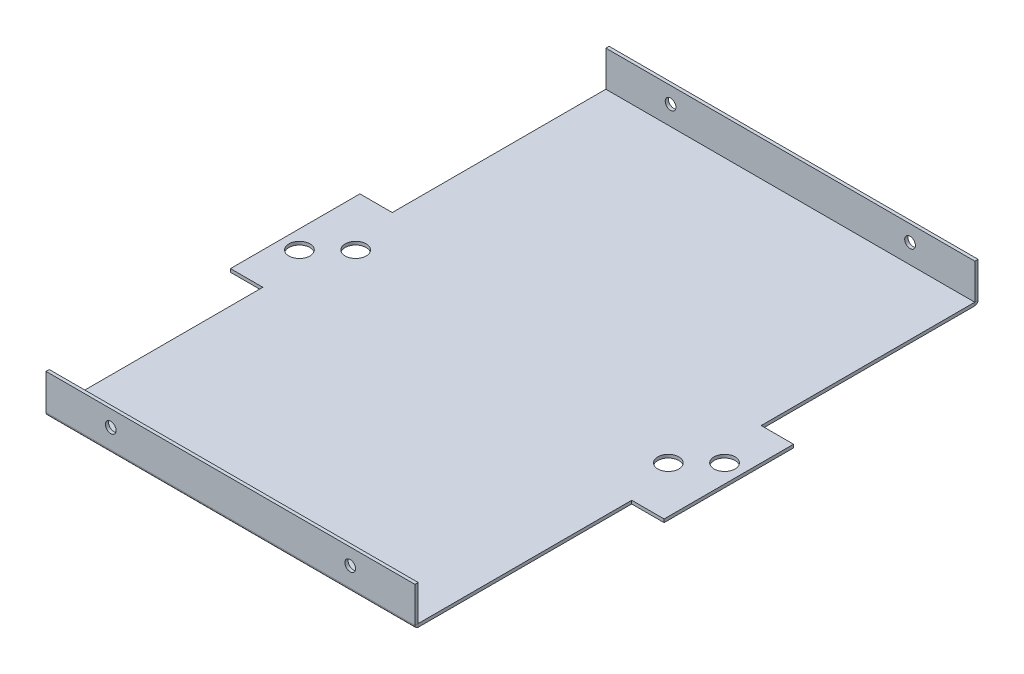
ISO-10303-21;
HEADER;
FILE_DESCRIPTION(('STEP AP214'),'2;1');
FILE_NAME('part.step','',(''),(''),'','','');
FILE_SCHEMA(('AUTOMOTIVE_DESIGN { 1 0 10303 214 1 1 1 1 }'));
ENDSEC;
DATA;
#1=APPLICATION_CONTEXT('core data for automotive mechanical design processes');
#2=APPLICATION_PROTOCOL_DEFINITION('international standard','automotive_design',2000,#1);
#3=PRODUCT_CONTEXT('',#1,'mechanical');
#4=PRODUCT('Part','Part','',(#3));
#5=PRODUCT_RELATED_PRODUCT_CATEGORY('part','',(#4));
#6=PRODUCT_DEFINITION_FORMATION('','',#4);
#7=PRODUCT_DEFINITION_CONTEXT('part definition',#1,'design');
#8=PRODUCT_DEFINITION('design','',#6,#7);
#9=PRODUCT_DEFINITION_SHAPE('','',#8);
#10=(LENGTH_UNIT() NAMED_UNIT(*) SI_UNIT(.MILLI.,.METRE.));
#11=(NAMED_UNIT(*) PLANE_ANGLE_UNIT() SI_UNIT($,.RADIAN.));
#12=(NAMED_UNIT(*) SI_UNIT($,.STERADIAN.) SOLID_ANGLE_UNIT());
#13=UNCERTAINTY_MEASURE_WITH_UNIT(LENGTH_MEASURE(1.E-05),#10,'distance_accuracy_value','');
#14=(GEOMETRIC_REPRESENTATION_CONTEXT(3) GLOBAL_UNCERTAINTY_ASSIGNED_CONTEXT((#13)) GLOBAL_UNIT_ASSIGNED_CONTEXT((#10,
#11,#12)) REPRESENTATION_CONTEXT('',''));
#15=CARTESIAN_POINT('',(0.,0.,0.));
#16=DIRECTION('',(0.,0.,1.));
#17=DIRECTION('',(1.,0.,0.));
#18=AXIS2_PLACEMENT_3D('',#15,#16,#17);
#19=CARTESIAN_POINT('',(114.,1.,0.));
#20=DIRECTION('',(-1.,0.,0.));
#21=DIRECTION('',(0.,0.,1.));
#22=AXIS2_PLACEMENT_3D('',#19,#20,#21);
#23=PLANE('',#22);
#24=DIRECTION('',(0.,0.,-1.));
#25=VECTOR('',#24,1.);
#26=CARTESIAN_POINT('',(114.,1.,0.));
#27=LINE('',#26,#25);
#28=CARTESIAN_POINT('',(114.,1.,-11.0001));
#29=VERTEX_POINT('',#28);
#30=CARTESIAN_POINT('',(114.,1.,-77.));
#31=VERTEX_POINT('',#30);
#32=EDGE_CURVE('E41',#29,#31,#27,.T.);
#33=ORIENTED_EDGE('',*,*,#32,.F.);
#34=DIRECTION('',(0.,-1.,0.));
#35=VECTOR('',#34,1.);
#36=CARTESIAN_POINT('',(114.,0.999999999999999,-11.0001));
#37=LINE('',#36,#35);
#38=CARTESIAN_POINT('',(114.,0.,-11.0001));
#39=VERTEX_POINT('',#38);
#40=EDGE_CURVE('E12',#29,#39,#37,.T.);
#41=ORIENTED_EDGE('',*,*,#40,.T.);
#42=DIRECTION('',(0.,0.,-1.));
#43=VECTOR('',#42,1.);
#44=CARTESIAN_POINT('',(114.,0.,0.));
#45=LINE('',#44,#43);
#46=CARTESIAN_POINT('',(114.,0.,-77.));
#47=VERTEX_POINT('',#46);
#48=EDGE_CURVE('E322',#39,#47,#45,.T.);
#49=ORIENTED_EDGE('',*,*,#48,.T.);
#50=DIRECTION('',(0.,-1.,0.));
#51=VECTOR('',#50,1.);
#52=CARTESIAN_POINT('',(114.,1.,-77.));
#53=LINE('',#52,#51);
#54=EDGE_CURVE('E354',#31,#47,#53,.T.);
#55=ORIENTED_EDGE('',*,*,#54,.F.);
#56=EDGE_LOOP('',(#33,#41,#49,#55));
#57=FACE_BOUND('',#56,.T.);
#58=ADVANCED_FACE('F38',(#57),#23,.F.);
#59=CARTESIAN_POINT('',(0.,1.,0.));
#60=DIRECTION('',(1.,0.,0.));
#61=DIRECTION('',(0.,0.,-1.));
#62=AXIS2_PLACEMENT_3D('',#59,#60,#61);
#63=PLANE('',#62);
#64=DIRECTION('',(0.,0.,1.));
#65=VECTOR('',#64,1.);
#66=CARTESIAN_POINT('',(0.,0.,0.));
#67=LINE('',#66,#65);
#68=CARTESIAN_POINT('',(0.,0.,-77.));
#69=VERTEX_POINT('',#68);
#70=CARTESIAN_POINT('',(0.,0.,-11.0000999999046));
#71=VERTEX_POINT('',#70);
#72=EDGE_CURVE('E301',#69,#71,#67,.T.);
#73=ORIENTED_EDGE('',*,*,#72,.T.);
#74=DIRECTION('',(0.,1.,0.));
#75=VECTOR('',#74,1.);
#76=CARTESIAN_POINT('',(0.,0.999999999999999,-11.0001));
#77=LINE('',#76,#75);
#78=CARTESIAN_POINT('',(0.,1.,-11.0001));
#79=VERTEX_POINT('',#78);
#80=EDGE_CURVE('E375',#71,#79,#77,.T.);
#81=ORIENTED_EDGE('',*,*,#80,.T.);
#82=DIRECTION('',(0.,0.,1.));
#83=VECTOR('',#82,1.);
#84=CARTESIAN_POINT('',(0.,1.,0.));
#85=LINE('',#84,#83);
#86=CARTESIAN_POINT('',(0.,1.,-77.));
#87=VERTEX_POINT('',#86);
#88=EDGE_CURVE('E333',#87,#79,#85,.T.);
#89=ORIENTED_EDGE('',*,*,#88,.F.);
#90=DIRECTION('',(0.,-1.,0.));
#91=VECTOR('',#90,1.);
#92=CARTESIAN_POINT('',(0.,1.,-77.));
#93=LINE('',#92,#91);
#94=EDGE_CURVE('E318',#87,#69,#93,.T.);
#95=ORIENTED_EDGE('',*,*,#94,.T.);
#96=EDGE_LOOP('',(#73,#81,#89,#95));
#97=FACE_BOUND('',#96,.T.);
#98=ADVANCED_FACE('F444',(#97),#63,.F.);
#99=CARTESIAN_POINT('',(0.,0.,-77.));
#100=DIRECTION('',(0.,1.,0.));
#101=DIRECTION('',(0.,0.,1.));
#102=AXIS2_PLACEMENT_3D('',#99,#100,#101);
#103=PLANE('',#102);
#104=CARTESIAN_POINT('',(-4.34314575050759,0.,-92.6568542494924));
#105=DIRECTION('',(0.,1.,0.));
#106=DIRECTION('',(0.,0.,1.));
#107=AXIS2_PLACEMENT_3D('',#104,#105,#106);
#108=CIRCLE('',#107,3.25);
#109=CARTESIAN_POINT('',(-4.34314575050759,0.,-89.4068542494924));
#110=VERTEX_POINT('',#109);
#111=EDGE_CURVE('E275',#110,#110,#108,.T.);
#112=ORIENTED_EDGE('',*,*,#111,.T.);
#113=EDGE_LOOP('',(#112));
#114=FACE_BOUND('',#113,.T.);
#115=CARTESIAN_POINT('',(109.656854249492,0.,-92.6568542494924));
#116=DIRECTION('',(0.,1.,0.));
#117=DIRECTION('',(0.,0.,1.));
#118=AXIS2_PLACEMENT_3D('',#115,#116,#117);
#119=CIRCLE('',#118,3.25000000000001);
#120=CARTESIAN_POINT('',(109.656854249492,0.,-89.4068542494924));
#121=VERTEX_POINT('',#120);
#122=EDGE_CURVE('E289',#121,#121,#119,.T.);
#123=ORIENTED_EDGE('',*,*,#122,.T.);
#124=EDGE_LOOP('',(#123));
#125=FACE_BOUND('',#124,.T.);
#126=CARTESIAN_POINT('',(118.343145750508,0.,-101.343145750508));
#127=DIRECTION('',(0.,1.,0.));
#128=DIRECTION('',(0.,0.,1.));
#129=AXIS2_PLACEMENT_3D('',#126,#127,#128);
#130=CIRCLE('',#129,3.25000000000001);
#131=CARTESIAN_POINT('',(118.343145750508,0.,-98.0931457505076));
#132=VERTEX_POINT('',#131);
#133=EDGE_CURVE('E295',#132,#132,#130,.T.);
#134=ORIENTED_EDGE('',*,*,#133,.T.);
#135=EDGE_LOOP('',(#134));
#136=FACE_BOUND('',#135,.T.);
#137=CARTESIAN_POINT('',(4.34314575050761,0.,-101.343145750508));
#138=DIRECTION('',(0.,1.,0.));
#139=DIRECTION('',(0.,0.,1.));
#140=AXIS2_PLACEMENT_3D('',#137,#138,#139);
#141=CIRCLE('',#140,3.25);
#142=CARTESIAN_POINT('',(4.34314575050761,0.,-98.0931457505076));
#143=VERTEX_POINT('',#142);
#144=EDGE_CURVE('E283',#143,#143,#141,.T.);
#145=ORIENTED_EDGE('',*,*,#144,.T.);
#146=EDGE_LOOP('',(#145));
#147=FACE_BOUND('',#146,.T.);
#148=ORIENTED_EDGE('',*,*,#48,.F.);
#149=DIRECTION('',(-1.,0.,0.));
#150=VECTOR('',#149,1.);
#151=CARTESIAN_POINT('',(0.,0.,-11.0001));
#152=LINE('',#151,#150);
#153=EDGE_CURVE('E46',#39,#71,#152,.T.);
#154=ORIENTED_EDGE('',*,*,#153,.T.);
#155=ORIENTED_EDGE('',*,*,#72,.F.);
#156=DIRECTION('',(1.,0.,0.));
#157=VECTOR('',#156,1.);
#158=CARTESIAN_POINT('',(0.,0.,-77.));
#159=LINE('',#158,#157);
#160=CARTESIAN_POINT('',(-9.99999999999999,0.,-77.));
#161=VERTEX_POINT('',#160);
#162=EDGE_CURVE('E331',#161,#69,#159,.T.);
#163=ORIENTED_EDGE('',*,*,#162,.F.);
#164=DIRECTION('',(0.,0.,1.));
#165=VECTOR('',#164,1.);
#166=CARTESIAN_POINT('',(-9.99999999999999,0.,-77.));
#167=LINE('',#166,#165);
#168=CARTESIAN_POINT('',(-10.,0.,-117.));
#169=VERTEX_POINT('',#168);
#170=EDGE_CURVE('E329',#169,#161,#167,.T.);
#171=ORIENTED_EDGE('',*,*,#170,.F.);
#172=DIRECTION('',(-1.,0.,0.));
#173=VECTOR('',#172,1.);
#174=CARTESIAN_POINT('',(-10.,0.,-117.));
#175=LINE('',#174,#173);
#176=CARTESIAN_POINT('',(0.,0.,-117.));
#177=VERTEX_POINT('',#176);
#178=EDGE_CURVE('E327',#177,#169,#175,.T.);
#179=ORIENTED_EDGE('',*,*,#178,.F.);
#180=DIRECTION('',(0.,0.,1.));
#181=VECTOR('',#180,1.);
#182=CARTESIAN_POINT('',(0.,0.,-117.));
#183=LINE('',#182,#181);
#184=CARTESIAN_POINT('',(0.,0.,-182.9999));
#185=VERTEX_POINT('',#184);
#186=EDGE_CURVE('E62',#185,#177,#183,.T.);
#187=ORIENTED_EDGE('',*,*,#186,.F.);
#188=DIRECTION('',(-1.,0.,0.));
#189=VECTOR('',#188,1.);
#190=CARTESIAN_POINT('',(0.,0.,-182.9999));
#191=LINE('',#190,#189);
#192=CARTESIAN_POINT('',(114.,0.,-182.9999));
#193=VERTEX_POINT('',#192);
#194=EDGE_CURVE('E363',#193,#185,#191,.T.);
#195=ORIENTED_EDGE('',*,*,#194,.F.);
#196=DIRECTION('',(0.,0.,-1.));
#197=VECTOR('',#196,1.);
#198=CARTESIAN_POINT('',(114.,0.,-117.));
#199=LINE('',#198,#197);
#200=CARTESIAN_POINT('',(114.,0.,-117.));
#201=VERTEX_POINT('',#200);
#202=EDGE_CURVE('E326',#201,#193,#199,.T.);
#203=ORIENTED_EDGE('',*,*,#202,.F.);
#204=DIRECTION('',(-1.,0.,0.));
#205=VECTOR('',#204,1.);
#206=CARTESIAN_POINT('',(114.,0.,-117.));
#207=LINE('',#206,#205);
#208=CARTESIAN_POINT('',(124.,0.,-117.));
#209=VERTEX_POINT('',#208);
#210=EDGE_CURVE('E324',#209,#201,#207,.T.);
#211=ORIENTED_EDGE('',*,*,#210,.F.);
#212=DIRECTION('',(0.,0.,-1.));
#213=VECTOR('',#212,1.);
#214=CARTESIAN_POINT('',(124.,0.,-117.));
#215=LINE('',#214,#213);
#216=CARTESIAN_POINT('',(124.,0.,-77.));
#217=VERTEX_POINT('',#216);
#218=EDGE_CURVE('E321',#217,#209,#215,.T.);
#219=ORIENTED_EDGE('',*,*,#218,.F.);
#220=DIRECTION('',(1.,0.,0.));
#221=VECTOR('',#220,1.);
#222=CARTESIAN_POINT('',(124.,0.,-77.));
#223=LINE('',#222,#221);
#224=EDGE_CURVE('E319',#47,#217,#223,.T.);
#225=ORIENTED_EDGE('',*,*,#224,.F.);
#226=EDGE_LOOP('',(#148,#154,#155,#163,#171,#179,#187,#195,#203,#211,#219,#225));
#227=FACE_BOUND('',#226,.T.);
#228=ADVANCED_FACE('F503',(#114,#125,#136,#147,#227),#103,.F.);
#229=CARTESIAN_POINT('',(0.,1.,-77.));
#230=DIRECTION('',(0.,1.,0.));
#231=DIRECTION('',(0.,0.,1.));
#232=AXIS2_PLACEMENT_3D('',#229,#230,#231);
#233=PLANE('',#232);
#234=DIRECTION('',(-1.,0.,0.));
#235=VECTOR('',#234,1.);
#236=CARTESIAN_POINT('',(0.,1.,-11.0001));
#237=LINE('',#236,#235);
#238=EDGE_CURVE('E369',#29,#79,#237,.T.);
#239=ORIENTED_EDGE('',*,*,#238,.F.);
#240=ORIENTED_EDGE('',*,*,#32,.T.);
#241=DIRECTION('',(1.,0.,0.));
#242=VECTOR('',#241,1.);
#243=CARTESIAN_POINT('',(124.,1.,-77.));
#244=LINE('',#243,#242);
#245=CARTESIAN_POINT('',(124.,1.,-77.));
#246=VERTEX_POINT('',#245);
#247=EDGE_CURVE('E304',#31,#246,#244,.T.);
#248=ORIENTED_EDGE('',*,*,#247,.T.);
#249=DIRECTION('',(0.,0.,-1.));
#250=VECTOR('',#249,1.);
#251=CARTESIAN_POINT('',(124.,1.,-117.));
#252=LINE('',#251,#250);
#253=CARTESIAN_POINT('',(124.,1.,-117.));
#254=VERTEX_POINT('',#253);
#255=EDGE_CURVE('E306',#246,#254,#252,.T.);
#256=ORIENTED_EDGE('',*,*,#255,.T.);
#257=DIRECTION('',(-1.,0.,0.));
#258=VECTOR('',#257,1.);
#259=CARTESIAN_POINT('',(114.,1.,-117.));
#260=LINE('',#259,#258);
#261=CARTESIAN_POINT('',(114.,1.,-117.));
#262=VERTEX_POINT('',#261);
#263=EDGE_CURVE('E308',#254,#262,#260,.T.);
#264=ORIENTED_EDGE('',*,*,#263,.T.);
#265=DIRECTION('',(0.,0.,-1.));
#266=VECTOR('',#265,1.);
#267=CARTESIAN_POINT('',(114.,1.,-117.));
#268=LINE('',#267,#266);
#269=CARTESIAN_POINT('',(114.,1.,-182.9999));
#270=VERTEX_POINT('',#269);
#271=EDGE_CURVE('E310',#262,#270,#268,.T.);
#272=ORIENTED_EDGE('',*,*,#271,.T.);
#273=DIRECTION('',(-1.,0.,0.));
#274=VECTOR('',#273,1.);
#275=CARTESIAN_POINT('',(0.,1.,-182.9999));
#276=LINE('',#275,#274);
#277=CARTESIAN_POINT('',(0.,0.999999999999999,-182.9999));
#278=VERTEX_POINT('',#277);
#279=EDGE_CURVE('E357',#270,#278,#276,.T.);
#280=ORIENTED_EDGE('',*,*,#279,.T.);
#281=DIRECTION('',(0.,0.,1.));
#282=VECTOR('',#281,1.);
#283=CARTESIAN_POINT('',(0.,1.,-117.));
#284=LINE('',#283,#282);
#285=CARTESIAN_POINT('',(0.,1.,-117.));
#286=VERTEX_POINT('',#285);
#287=EDGE_CURVE('E314',#278,#286,#284,.T.);
#288=ORIENTED_EDGE('',*,*,#287,.T.);
#289=DIRECTION('',(-1.,0.,0.));
#290=VECTOR('',#289,1.);
#291=CARTESIAN_POINT('',(-10.,1.,-117.));
#292=LINE('',#291,#290);
#293=CARTESIAN_POINT('',(-10.,1.,-117.));
#294=VERTEX_POINT('',#293);
#295=EDGE_CURVE('E311',#286,#294,#292,.T.);
#296=ORIENTED_EDGE('',*,*,#295,.T.);
#297=DIRECTION('',(0.,0.,1.));
#298=VECTOR('',#297,1.);
#299=CARTESIAN_POINT('',(-9.99999999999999,1.,-77.));
#300=LINE('',#299,#298);
#301=CARTESIAN_POINT('',(-9.99999999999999,1.,-77.));
#302=VERTEX_POINT('',#301);
#303=EDGE_CURVE('E313',#294,#302,#300,.T.);
#304=ORIENTED_EDGE('',*,*,#303,.T.);
#305=DIRECTION('',(1.,0.,0.));
#306=VECTOR('',#305,1.);
#307=CARTESIAN_POINT('',(0.,1.,-77.));
#308=LINE('',#307,#306);
#309=EDGE_CURVE('E316',#302,#87,#308,.T.);
#310=ORIENTED_EDGE('',*,*,#309,.T.);
#311=ORIENTED_EDGE('',*,*,#88,.T.);
#312=EDGE_LOOP('',(#239,#240,#248,#256,#264,#272,#280,#288,#296,#304,#310,#311));
#313=FACE_BOUND('',#312,.T.);
#314=CARTESIAN_POINT('',(-4.34314575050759,1.,-92.6568542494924));
#315=DIRECTION('',(0.,1.,0.));
#316=DIRECTION('',(0.,0.,1.));
#317=AXIS2_PLACEMENT_3D('',#314,#315,#316);
#318=CIRCLE('',#317,3.25);
#319=CARTESIAN_POINT('',(-4.34314575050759,1.,-89.4068542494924));
#320=VERTEX_POINT('',#319);
#321=EDGE_CURVE('E280',#320,#320,#318,.T.);
#322=ORIENTED_EDGE('',*,*,#321,.F.);
#323=EDGE_LOOP('',(#322));
#324=FACE_BOUND('',#323,.T.);
#325=CARTESIAN_POINT('',(109.656854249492,1.,-92.6568542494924));
#326=DIRECTION('',(0.,1.,0.));
#327=DIRECTION('',(0.,0.,1.));
#328=AXIS2_PLACEMENT_3D('',#325,#326,#327);
#329=CIRCLE('',#328,3.25000000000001);
#330=CARTESIAN_POINT('',(109.656854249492,1.,-89.4068542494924));
#331=VERTEX_POINT('',#330);
#332=EDGE_CURVE('E292',#331,#331,#329,.T.);
#333=ORIENTED_EDGE('',*,*,#332,.F.);
#334=EDGE_LOOP('',(#333));
#335=FACE_BOUND('',#334,.T.);
#336=CARTESIAN_POINT('',(118.343145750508,1.,-101.343145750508));
#337=DIRECTION('',(0.,1.,0.));
#338=DIRECTION('',(0.,0.,1.));
#339=AXIS2_PLACEMENT_3D('',#336,#337,#338);
#340=CIRCLE('',#339,3.25000000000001);
#341=CARTESIAN_POINT('',(118.343145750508,1.,-98.0931457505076));
#342=VERTEX_POINT('',#341);
#343=EDGE_CURVE('E298',#342,#342,#340,.T.);
#344=ORIENTED_EDGE('',*,*,#343,.F.);
#345=EDGE_LOOP('',(#344));
#346=FACE_BOUND('',#345,.T.);
#347=CARTESIAN_POINT('',(4.34314575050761,1.,-101.343145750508));
#348=DIRECTION('',(0.,1.,0.));
#349=DIRECTION('',(0.,0.,1.));
#350=AXIS2_PLACEMENT_3D('',#347,#348,#349);
#351=CIRCLE('',#350,3.25);
#352=CARTESIAN_POINT('',(4.34314575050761,1.,-98.0931457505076));
#353=VERTEX_POINT('',#352);
#354=EDGE_CURVE('E286',#353,#353,#351,.T.);
#355=ORIENTED_EDGE('',*,*,#354,.F.);
#356=EDGE_LOOP('',(#355));
#357=FACE_BOUND('',#356,.T.);
#358=ADVANCED_FACE('F388',(#313,#324,#335,#346,#357),#233,.T.);
#359=CARTESIAN_POINT('',(124.,1.,-77.));
#360=DIRECTION('',(0.,0.,-1.));
#361=DIRECTION('',(-1.,0.,0.));
#362=AXIS2_PLACEMENT_3D('',#359,#360,#361);
#363=PLANE('',#362);
#364=ORIENTED_EDGE('',*,*,#224,.T.);
#365=DIRECTION('',(0.,-1.,0.));
#366=VECTOR('',#365,1.);
#367=CARTESIAN_POINT('',(124.,1.,-77.));
#368=LINE('',#367,#366);
#369=EDGE_CURVE('E351',#246,#217,#368,.T.);
#370=ORIENTED_EDGE('',*,*,#369,.F.);
#371=ORIENTED_EDGE('',*,*,#247,.F.);
#372=ORIENTED_EDGE('',*,*,#54,.T.);
#373=EDGE_LOOP('',(#364,#370,#371,#372));
#374=FACE_BOUND('',#373,.T.);
#375=ADVANCED_FACE('F396',(#374),#363,.F.);
#376=CARTESIAN_POINT('',(124.,1.,-117.));
#377=DIRECTION('',(-1.,0.,0.));
#378=DIRECTION('',(0.,0.,1.));
#379=AXIS2_PLACEMENT_3D('',#376,#377,#378);
#380=PLANE('',#379);
#381=ORIENTED_EDGE('',*,*,#218,.T.);
#382=DIRECTION('',(0.,-1.,0.));
#383=VECTOR('',#382,1.);
#384=CARTESIAN_POINT('',(124.,1.,-117.));
#385=LINE('',#384,#383);
#386=EDGE_CURVE('E348',#254,#209,#385,.T.);
#387=ORIENTED_EDGE('',*,*,#386,.F.);
#388=ORIENTED_EDGE('',*,*,#255,.F.);
#389=ORIENTED_EDGE('',*,*,#369,.T.);
#390=EDGE_LOOP('',(#381,#387,#388,#389));
#391=FACE_BOUND('',#390,.T.);
#392=ADVANCED_FACE('F401',(#391),#380,.F.);
#393=CARTESIAN_POINT('',(114.,1.,-117.));
#394=DIRECTION('',(0.,0.,1.));
#395=DIRECTION('',(1.,0.,0.));
#396=AXIS2_PLACEMENT_3D('',#393,#394,#395);
#397=PLANE('',#396);
#398=ORIENTED_EDGE('',*,*,#210,.T.);
#399=DIRECTION('',(0.,-1.,0.));
#400=VECTOR('',#399,1.);
#401=CARTESIAN_POINT('',(114.,1.,-117.));
#402=LINE('',#401,#400);
#403=EDGE_CURVE('E345',#262,#201,#402,.T.);
#404=ORIENTED_EDGE('',*,*,#403,.F.);
#405=ORIENTED_EDGE('',*,*,#263,.F.);
#406=ORIENTED_EDGE('',*,*,#386,.T.);
#407=EDGE_LOOP('',(#398,#404,#405,#406));
#408=FACE_BOUND('',#407,.T.);
#409=ADVANCED_FACE('F407',(#408),#397,.F.);
#410=CARTESIAN_POINT('',(114.,1.,-117.));
#411=DIRECTION('',(-1.,0.,0.));
#412=DIRECTION('',(0.,0.,1.));
#413=AXIS2_PLACEMENT_3D('',#410,#411,#412);
#414=PLANE('',#413);
#415=DIRECTION('',(0.,-1.,0.));
#416=VECTOR('',#415,1.);
#417=CARTESIAN_POINT('',(114.,0.999999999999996,-182.9999));
#418=LINE('',#417,#416);
#419=EDGE_CURVE('E360',#270,#193,#418,.T.);
#420=ORIENTED_EDGE('',*,*,#419,.F.);
#421=ORIENTED_EDGE('',*,*,#271,.F.);
#422=ORIENTED_EDGE('',*,*,#403,.T.);
#423=ORIENTED_EDGE('',*,*,#202,.T.);
#424=EDGE_LOOP('',(#420,#421,#422,#423));
#425=FACE_BOUND('',#424,.T.);
#426=ADVANCED_FACE('F411',(#425),#414,.F.);
#427=CARTESIAN_POINT('',(0.,1.,-117.));
#428=DIRECTION('',(1.,0.,0.));
#429=DIRECTION('',(0.,0.,-1.));
#430=AXIS2_PLACEMENT_3D('',#427,#428,#429);
#431=PLANE('',#430);
#432=DIRECTION('',(0.,1.,0.));
#433=VECTOR('',#432,1.);
#434=CARTESIAN_POINT('',(0.,0.999999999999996,-182.9999));
#435=LINE('',#434,#433);
#436=EDGE_CURVE('E366',#185,#278,#435,.T.);
#437=ORIENTED_EDGE('',*,*,#436,.F.);
#438=ORIENTED_EDGE('',*,*,#186,.T.);
#439=DIRECTION('',(0.,-1.,0.));
#440=VECTOR('',#439,1.);
#441=CARTESIAN_POINT('',(0.,1.,-117.));
#442=LINE('',#441,#440);
#443=EDGE_CURVE('E342',#286,#177,#442,.T.);
#444=ORIENTED_EDGE('',*,*,#443,.F.);
#445=ORIENTED_EDGE('',*,*,#287,.F.);
#446=EDGE_LOOP('',(#437,#438,#444,#445));
#447=FACE_BOUND('',#446,.T.);
#448=ADVANCED_FACE('F427',(#447),#431,.F.);
#449=CARTESIAN_POINT('',(-10.,1.,-117.));
#450=DIRECTION('',(0.,0.,1.));
#451=DIRECTION('',(1.,0.,0.));
#452=AXIS2_PLACEMENT_3D('',#449,#450,#451);
#453=PLANE('',#452);
#454=ORIENTED_EDGE('',*,*,#178,.T.);
#455=DIRECTION('',(0.,-1.,0.));
#456=VECTOR('',#455,1.);
#457=CARTESIAN_POINT('',(-10.,1.,-117.));
#458=LINE('',#457,#456);
#459=EDGE_CURVE('E339',#294,#169,#458,.T.);
#460=ORIENTED_EDGE('',*,*,#459,.F.);
#461=ORIENTED_EDGE('',*,*,#295,.F.);
#462=ORIENTED_EDGE('',*,*,#443,.T.);
#463=EDGE_LOOP('',(#454,#460,#461,#462));
#464=FACE_BOUND('',#463,.T.);
#465=ADVANCED_FACE('F431',(#464),#453,.F.);
#466=CARTESIAN_POINT('',(-9.99999999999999,1.,-77.));
#467=DIRECTION('',(1.,0.,0.));
#468=DIRECTION('',(0.,0.,-1.));
#469=AXIS2_PLACEMENT_3D('',#466,#467,#468);
#470=PLANE('',#469);
#471=ORIENTED_EDGE('',*,*,#170,.T.);
#472=DIRECTION('',(0.,-1.,0.));
#473=VECTOR('',#472,1.);
#474=CARTESIAN_POINT('',(-9.99999999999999,1.,-77.));
#475=LINE('',#474,#473);
#476=EDGE_CURVE('E336',#302,#161,#475,.T.);
#477=ORIENTED_EDGE('',*,*,#476,.F.);
#478=ORIENTED_EDGE('',*,*,#303,.F.);
#479=ORIENTED_EDGE('',*,*,#459,.T.);
#480=EDGE_LOOP('',(#471,#477,#478,#479));
#481=FACE_BOUND('',#480,.T.);
#482=ADVANCED_FACE('F437',(#481),#470,.F.);
#483=CARTESIAN_POINT('',(0.,1.,-77.));
#484=DIRECTION('',(0.,0.,-1.));
#485=DIRECTION('',(-1.,0.,0.));
#486=AXIS2_PLACEMENT_3D('',#483,#484,#485);
#487=PLANE('',#486);
#488=ORIENTED_EDGE('',*,*,#162,.T.);
#489=ORIENTED_EDGE('',*,*,#94,.F.);
#490=ORIENTED_EDGE('',*,*,#309,.F.);
#491=ORIENTED_EDGE('',*,*,#476,.T.);
#492=EDGE_LOOP('',(#488,#489,#490,#491));
#493=FACE_BOUND('',#492,.T.);
#494=ADVANCED_FACE('F441',(#493),#487,.F.);
#495=CARTESIAN_POINT('',(118.343145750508,1.,-101.343145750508));
#496=DIRECTION('',(0.,-1.,0.));
#497=DIRECTION('',(0.,0.,-1.));
#498=AXIS2_PLACEMENT_3D('',#495,#496,#497);
#499=CYLINDRICAL_SURFACE('',#498,3.25000000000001);
#500=ORIENTED_EDGE('',*,*,#343,.T.);
#501=EDGE_LOOP('',(#500));
#502=FACE_BOUND('',#501,.T.);
#503=ORIENTED_EDGE('',*,*,#133,.F.);
#504=EDGE_LOOP('',(#503));
#505=FACE_BOUND('',#504,.T.);
#506=ADVANCED_FACE('F528',(#502,#505),#499,.F.);
#507=CARTESIAN_POINT('',(109.656854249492,1.,-92.6568542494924));
#508=DIRECTION('',(0.,-1.,0.));
#509=DIRECTION('',(0.,0.,-1.));
#510=AXIS2_PLACEMENT_3D('',#507,#508,#509);
#511=CYLINDRICAL_SURFACE('',#510,3.25000000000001);
#512=ORIENTED_EDGE('',*,*,#332,.T.);
#513=EDGE_LOOP('',(#512));
#514=FACE_BOUND('',#513,.T.);
#515=ORIENTED_EDGE('',*,*,#122,.F.);
#516=EDGE_LOOP('',(#515));
#517=FACE_BOUND('',#516,.T.);
#518=ADVANCED_FACE('F531',(#514,#517),#511,.F.);
#519=CARTESIAN_POINT('',(4.34314575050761,1.,-101.343145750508));
#520=DIRECTION('',(0.,-1.,0.));
#521=DIRECTION('',(0.,0.,-1.));
#522=AXIS2_PLACEMENT_3D('',#519,#520,#521);
#523=CYLINDRICAL_SURFACE('',#522,3.25);
#524=ORIENTED_EDGE('',*,*,#354,.T.);
#525=EDGE_LOOP('',(#524));
#526=FACE_BOUND('',#525,.T.);
#527=ORIENTED_EDGE('',*,*,#144,.F.);
#528=EDGE_LOOP('',(#527));
#529=FACE_BOUND('',#528,.T.);
#530=ADVANCED_FACE('F535',(#526,#529),#523,.F.);
#531=CARTESIAN_POINT('',(-4.34314575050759,1.,-92.6568542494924));
#532=DIRECTION('',(0.,-1.,0.));
#533=DIRECTION('',(0.,0.,-1.));
#534=AXIS2_PLACEMENT_3D('',#531,#532,#533);
#535=CYLINDRICAL_SURFACE('',#534,3.25);
#536=ORIENTED_EDGE('',*,*,#321,.T.);
#537=EDGE_LOOP('',(#536));
#538=FACE_BOUND('',#537,.T.);
#539=ORIENTED_EDGE('',*,*,#111,.F.);
#540=EDGE_LOOP('',(#539));
#541=FACE_BOUND('',#540,.T.);
#542=ADVANCED_FACE('F539',(#538,#541),#535,.F.);
#543=CARTESIAN_POINT('',(114.,1.0001,-182.9999));
#544=DIRECTION('',(-1.,0.,0.));
#545=DIRECTION('',(0.,0.,1.));
#546=AXIS2_PLACEMENT_3D('',#543,#544,#545);
#547=PLANE('',#546);
#548=ORIENTED_EDGE('',*,*,#419,.T.);
#549=CARTESIAN_POINT('',(114.,1.0001,-182.9999));
#550=DIRECTION('',(-1.,0.,0.));
#551=DIRECTION('',(0.,0.,1.));
#552=AXIS2_PLACEMENT_3D('',#549,#550,#551);
#553=CIRCLE('',#552,1.0001);
#554=CARTESIAN_POINT('',(114.,1.0001,-184.));
#555=VERTEX_POINT('',#554);
#556=EDGE_CURVE('E229',#193,#555,#553,.F.);
#557=ORIENTED_EDGE('',*,*,#556,.T.);
#558=DIRECTION('',(0.,0.,-1.));
#559=VECTOR('',#558,1.);
#560=CARTESIAN_POINT('',(114.,1.00010000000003,-183.));
#561=LINE('',#560,#559);
#562=CARTESIAN_POINT('',(114.,1.0001,-183.));
#563=VERTEX_POINT('',#562);
#564=EDGE_CURVE('E245',#563,#555,#561,.T.);
#565=ORIENTED_EDGE('',*,*,#564,.F.);
#566=CARTESIAN_POINT('',(114.,1.0001,-182.9999));
#567=DIRECTION('',(1.,0.,0.));
#568=DIRECTION('',(0.,0.,-1.));
#569=AXIS2_PLACEMENT_3D('',#566,#567,#568);
#570=CIRCLE('',#569,0.000100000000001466);
#571=EDGE_CURVE('E268',#270,#563,#570,.T.);
#572=ORIENTED_EDGE('',*,*,#571,.F.);
#573=EDGE_LOOP('',(#548,#557,#565,#572));
#574=FACE_BOUND('',#573,.T.);
#575=ADVANCED_FACE('F417',(#574),#547,.F.);
#576=CARTESIAN_POINT('',(0.,1.0001,-182.9999));
#577=DIRECTION('',(1.,0.,0.));
#578=DIRECTION('',(0.,0.,-1.));
#579=AXIS2_PLACEMENT_3D('',#576,#577,#578);
#580=PLANE('',#579);
#581=DIRECTION('',(0.,0.,1.));
#582=VECTOR('',#581,1.);
#583=CARTESIAN_POINT('',(0.,1.00010000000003,-183.));
#584=LINE('',#583,#582);
#585=CARTESIAN_POINT('',(0.,1.0001,-184.));
#586=VERTEX_POINT('',#585);
#587=CARTESIAN_POINT('',(0.,1.00010000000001,-183.));
#588=VERTEX_POINT('',#587);
#589=EDGE_CURVE('E230',#586,#588,#584,.T.);
#590=ORIENTED_EDGE('',*,*,#589,.F.);
#591=CARTESIAN_POINT('',(0.,1.0001,-182.9999));
#592=DIRECTION('',(-1.,0.,0.));
#593=DIRECTION('',(0.,0.,1.));
#594=AXIS2_PLACEMENT_3D('',#591,#592,#593);
#595=CIRCLE('',#594,1.0001);
#596=EDGE_CURVE('E272',#586,#185,#595,.T.);
#597=ORIENTED_EDGE('',*,*,#596,.T.);
#598=ORIENTED_EDGE('',*,*,#436,.T.);
#599=CARTESIAN_POINT('',(0.,1.0001,-182.9999));
#600=DIRECTION('',(-1.,0.,0.));
#601=DIRECTION('',(0.,0.,1.));
#602=AXIS2_PLACEMENT_3D('',#599,#600,#601);
#603=CIRCLE('',#602,0.000100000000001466);
#604=EDGE_CURVE('E271',#588,#278,#603,.T.);
#605=ORIENTED_EDGE('',*,*,#604,.F.);
#606=EDGE_LOOP('',(#590,#597,#598,#605));
#607=FACE_BOUND('',#606,.T.);
#608=ADVANCED_FACE('F424',(#607),#580,.F.);
#609=CARTESIAN_POINT('',(171.004385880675,1.0001,-182.9999));
#610=DIRECTION('',(-1.,0.,0.));
#611=DIRECTION('',(0.,0.,1.));
#612=AXIS2_PLACEMENT_3D('',#609,#610,#611);
#613=CYLINDRICAL_SURFACE('',#612,0.0001);
#614=ORIENTED_EDGE('',*,*,#604,.T.);
#615=ORIENTED_EDGE('',*,*,#279,.F.);
#616=ORIENTED_EDGE('',*,*,#571,.T.);
#617=DIRECTION('',(-1.,0.,0.));
#618=VECTOR('',#617,1.);
#619=CARTESIAN_POINT('',(0.,1.00010000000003,-183.));
#620=LINE('',#619,#618);
#621=EDGE_CURVE('E222',#563,#588,#620,.T.);
#622=ORIENTED_EDGE('',*,*,#621,.T.);
#623=EDGE_LOOP('',(#614,#615,#616,#622));
#624=FACE_BOUND('',#623,.T.);
#625=ADVANCED_FACE('F419',(#624),#613,.F.);
#626=CARTESIAN_POINT('',(171.004385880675,1.0001,-182.9999));
#627=DIRECTION('',(-1.,0.,0.));
#628=DIRECTION('',(0.,0.,1.));
#629=AXIS2_PLACEMENT_3D('',#626,#627,#628);
#630=CYLINDRICAL_SURFACE('',#629,1.0001);
#631=ORIENTED_EDGE('',*,*,#596,.F.);
#632=DIRECTION('',(-1.,0.,0.));
#633=VECTOR('',#632,1.);
#634=CARTESIAN_POINT('',(0.,1.00010000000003,-184.));
#635=LINE('',#634,#633);
#636=EDGE_CURVE('E234',#555,#586,#635,.T.);
#637=ORIENTED_EDGE('',*,*,#636,.F.);
#638=ORIENTED_EDGE('',*,*,#556,.F.);
#639=ORIENTED_EDGE('',*,*,#194,.T.);
#640=EDGE_LOOP('',(#631,#637,#638,#639));
#641=FACE_BOUND('',#640,.T.);
#642=ADVANCED_FACE('F548',(#641),#630,.T.);
#643=CARTESIAN_POINT('',(20.,7.00002721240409,-183.));
#644=DIRECTION('',(0.,0.,-1.));
#645=DIRECTION('',(0.,1.,0.));
#646=AXIS2_PLACEMENT_3D('',#643,#644,#645);
#647=CYLINDRICAL_SURFACE('',#646,1.65000000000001);
#648=CARTESIAN_POINT('',(20.,7.00002721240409,-183.));
#649=DIRECTION('',(0.,0.,1.));
#650=DIRECTION('',(0.,-1.,0.));
#651=AXIS2_PLACEMENT_3D('',#648,#649,#650);
#652=CIRCLE('',#651,1.65000000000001);
#653=CARTESIAN_POINT('',(20.,5.35002721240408,-183.));
#654=VERTEX_POINT('',#653);
#655=EDGE_CURVE('E263',#654,#654,#652,.T.);
#656=ORIENTED_EDGE('',*,*,#655,.T.);
#657=EDGE_LOOP('',(#656));
#658=FACE_BOUND('',#657,.T.);
#659=CARTESIAN_POINT('',(20.,7.00002721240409,-184.));
#660=DIRECTION('',(0.,0.,1.));
#661=DIRECTION('',(0.,-1.,0.));
#662=AXIS2_PLACEMENT_3D('',#659,#660,#661);
#663=CIRCLE('',#662,1.65000000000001);
#664=CARTESIAN_POINT('',(20.,5.35002721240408,-184.));
#665=VERTEX_POINT('',#664);
#666=EDGE_CURVE('E237',#665,#665,#663,.T.);
#667=ORIENTED_EDGE('',*,*,#666,.F.);
#668=EDGE_LOOP('',(#667));
#669=FACE_BOUND('',#668,.T.);
#670=ADVANCED_FACE('F551',(#658,#669),#647,.F.);
#671=CARTESIAN_POINT('',(94.,7.00002721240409,-183.));
#672=DIRECTION('',(0.,0.,-1.));
#673=DIRECTION('',(0.,1.,0.));
#674=AXIS2_PLACEMENT_3D('',#671,#672,#673);
#675=CYLINDRICAL_SURFACE('',#674,1.65000000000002);
#676=CARTESIAN_POINT('',(94.,7.00002721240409,-183.));
#677=DIRECTION('',(0.,0.,1.));
#678=DIRECTION('',(0.,-1.,0.));
#679=AXIS2_PLACEMENT_3D('',#676,#677,#678);
#680=CIRCLE('',#679,1.65000000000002);
#681=CARTESIAN_POINT('',(94.,5.35002721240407,-183.));
#682=VERTEX_POINT('',#681);
#683=EDGE_CURVE('E260',#682,#682,#680,.T.);
#684=ORIENTED_EDGE('',*,*,#683,.T.);
#685=EDGE_LOOP('',(#684));
#686=FACE_BOUND('',#685,.T.);
#687=CARTESIAN_POINT('',(94.,7.00002721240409,-184.));
#688=DIRECTION('',(0.,0.,1.));
#689=DIRECTION('',(0.,-1.,0.));
#690=AXIS2_PLACEMENT_3D('',#687,#688,#689);
#691=CIRCLE('',#690,1.65000000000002);
#692=CARTESIAN_POINT('',(94.,5.35002721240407,-184.));
#693=VERTEX_POINT('',#692);
#694=EDGE_CURVE('E240',#693,#693,#691,.T.);
#695=ORIENTED_EDGE('',*,*,#694,.F.);
#696=EDGE_LOOP('',(#695));
#697=FACE_BOUND('',#696,.T.);
#698=ADVANCED_FACE('F574',(#686,#697),#675,.F.);
#699=CARTESIAN_POINT('',(0.,12.0000272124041,-183.));
#700=DIRECTION('',(0.,-1.,0.));
#701=DIRECTION('',(1.,0.,0.));
#702=AXIS2_PLACEMENT_3D('',#699,#700,#701);
#703=PLANE('',#702);
#704=DIRECTION('',(-1.,0.,0.));
#705=VECTOR('',#704,1.);
#706=CARTESIAN_POINT('',(0.,12.0000272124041,-184.));
#707=LINE('',#706,#705);
#708=CARTESIAN_POINT('',(114.,12.0000272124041,-184.));
#709=VERTEX_POINT('',#708);
#710=CARTESIAN_POINT('',(0.,12.0000272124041,-184.));
#711=VERTEX_POINT('',#710);
#712=EDGE_CURVE('E258',#709,#711,#707,.T.);
#713=ORIENTED_EDGE('',*,*,#712,.T.);
#714=DIRECTION('',(0.,0.,-1.));
#715=VECTOR('',#714,1.);
#716=CARTESIAN_POINT('',(0.,12.0000272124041,-183.));
#717=LINE('',#716,#715);
#718=CARTESIAN_POINT('',(0.,12.0000272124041,-183.));
#719=VERTEX_POINT('',#718);
#720=EDGE_CURVE('E226',#719,#711,#717,.T.);
#721=ORIENTED_EDGE('',*,*,#720,.F.);
#722=DIRECTION('',(-1.,0.,0.));
#723=VECTOR('',#722,1.);
#724=CARTESIAN_POINT('',(0.,12.0000272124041,-183.));
#725=LINE('',#724,#723);
#726=CARTESIAN_POINT('',(114.,12.0000272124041,-183.));
#727=VERTEX_POINT('',#726);
#728=EDGE_CURVE('E251',#727,#719,#725,.T.);
#729=ORIENTED_EDGE('',*,*,#728,.F.);
#730=DIRECTION('',(0.,0.,-1.));
#731=VECTOR('',#730,1.);
#732=CARTESIAN_POINT('',(114.,12.0000272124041,-183.));
#733=LINE('',#732,#731);
#734=EDGE_CURVE('E255',#727,#709,#733,.T.);
#735=ORIENTED_EDGE('',*,*,#734,.T.);
#736=EDGE_LOOP('',(#713,#721,#729,#735));
#737=FACE_BOUND('',#736,.T.);
#738=ADVANCED_FACE('F570',(#737),#703,.F.);
#739=CARTESIAN_POINT('',(0.,-104.999972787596,-183.));
#740=DIRECTION('',(0.,0.,1.));
#741=DIRECTION('',(0.,-1.,0.));
#742=AXIS2_PLACEMENT_3D('',#739,#740,#741);
#743=PLANE('',#742);
#744=ORIENTED_EDGE('',*,*,#621,.F.);
#745=DIRECTION('',(0.,1.,0.));
#746=VECTOR('',#745,1.);
#747=CARTESIAN_POINT('',(114.,-64.9999727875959,-183.));
#748=LINE('',#747,#746);
#749=EDGE_CURVE('E253',#563,#727,#748,.T.);
#750=ORIENTED_EDGE('',*,*,#749,.T.);
#751=ORIENTED_EDGE('',*,*,#728,.T.);
#752=DIRECTION('',(0.,-1.,0.));
#753=VECTOR('',#752,1.);
#754=CARTESIAN_POINT('',(0.,-64.9999727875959,-183.));
#755=LINE('',#754,#753);
#756=EDGE_CURVE('E248',#719,#588,#755,.T.);
#757=ORIENTED_EDGE('',*,*,#756,.T.);
#758=EDGE_LOOP('',(#744,#750,#751,#757));
#759=FACE_BOUND('',#758,.T.);
#760=ORIENTED_EDGE('',*,*,#683,.F.);
#761=EDGE_LOOP('',(#760));
#762=FACE_BOUND('',#761,.T.);
#763=ORIENTED_EDGE('',*,*,#655,.F.);
#764=EDGE_LOOP('',(#763));
#765=FACE_BOUND('',#764,.T.);
#766=ADVANCED_FACE('F566',(#759,#762,#765),#743,.T.);
#767=CARTESIAN_POINT('',(114.,-64.9999727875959,-183.));
#768=DIRECTION('',(-1.,0.,0.));
#769=DIRECTION('',(0.,-1.,0.));
#770=AXIS2_PLACEMENT_3D('',#767,#768,#769);
#771=PLANE('',#770);
#772=ORIENTED_EDGE('',*,*,#749,.F.);
#773=ORIENTED_EDGE('',*,*,#564,.T.);
#774=DIRECTION('',(0.,1.,0.));
#775=VECTOR('',#774,1.);
#776=CARTESIAN_POINT('',(114.,-64.9999727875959,-184.));
#777=LINE('',#776,#775);
#778=EDGE_CURVE('E243',#555,#709,#777,.T.);
#779=ORIENTED_EDGE('',*,*,#778,.T.);
#780=ORIENTED_EDGE('',*,*,#734,.F.);
#781=EDGE_LOOP('',(#772,#773,#779,#780));
#782=FACE_BOUND('',#781,.T.);
#783=ADVANCED_FACE('F562',(#782),#771,.F.);
#784=CARTESIAN_POINT('',(0.,-104.999972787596,-184.));
#785=DIRECTION('',(0.,0.,1.));
#786=DIRECTION('',(0.,-1.,0.));
#787=AXIS2_PLACEMENT_3D('',#784,#785,#786);
#788=PLANE('',#787);
#789=ORIENTED_EDGE('',*,*,#694,.T.);
#790=EDGE_LOOP('',(#789));
#791=FACE_BOUND('',#790,.T.);
#792=ORIENTED_EDGE('',*,*,#666,.T.);
#793=EDGE_LOOP('',(#792));
#794=FACE_BOUND('',#793,.T.);
#795=ORIENTED_EDGE('',*,*,#778,.F.);
#796=ORIENTED_EDGE('',*,*,#636,.T.);
#797=DIRECTION('',(0.,-1.,0.));
#798=VECTOR('',#797,1.);
#799=CARTESIAN_POINT('',(0.,-64.9999727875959,-184.));
#800=LINE('',#799,#798);
#801=EDGE_CURVE('E232',#711,#586,#800,.T.);
#802=ORIENTED_EDGE('',*,*,#801,.F.);
#803=ORIENTED_EDGE('',*,*,#712,.F.);
#804=EDGE_LOOP('',(#795,#796,#802,#803));
#805=FACE_BOUND('',#804,.T.);
#806=ADVANCED_FACE('F558',(#791,#794,#805),#788,.F.);
#807=CARTESIAN_POINT('',(0.,-64.9999727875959,-183.));
#808=DIRECTION('',(1.,0.,0.));
#809=DIRECTION('',(0.,1.,0.));
#810=AXIS2_PLACEMENT_3D('',#807,#808,#809);
#811=PLANE('',#810);
#812=ORIENTED_EDGE('',*,*,#801,.T.);
#813=ORIENTED_EDGE('',*,*,#589,.T.);
#814=ORIENTED_EDGE('',*,*,#756,.F.);
#815=ORIENTED_EDGE('',*,*,#720,.T.);
#816=EDGE_LOOP('',(#812,#813,#814,#815));
#817=FACE_BOUND('',#816,.T.);
#818=ADVANCED_FACE('F555',(#817),#811,.F.);
#819=CARTESIAN_POINT('',(114.,1.0001,-11.0001));
#820=DIRECTION('',(-1.,0.,0.));
#821=DIRECTION('',(0.,0.,1.));
#822=AXIS2_PLACEMENT_3D('',#819,#820,#821);
#823=PLANE('',#822);
#824=DIRECTION('',(0.,0.,1.));
#825=VECTOR('',#824,1.);
#826=CARTESIAN_POINT('',(114.,1.0001,-11.));
#827=LINE('',#826,#825);
#828=CARTESIAN_POINT('',(114.,1.0001,-11.));
#829=VERTEX_POINT('',#828);
#830=CARTESIAN_POINT('',(114.,1.0001,-10.));
#831=VERTEX_POINT('',#830);
#832=EDGE_CURVE('E213',#829,#831,#827,.T.);
#833=ORIENTED_EDGE('',*,*,#832,.T.);
#834=CARTESIAN_POINT('',(114.,1.0001,-11.0001));
#835=DIRECTION('',(1.,0.,0.));
#836=DIRECTION('',(0.,0.,-1.));
#837=AXIS2_PLACEMENT_3D('',#834,#835,#836);
#838=CIRCLE('',#837,1.0001);
#839=EDGE_CURVE('E54',#831,#39,#838,.T.);
#840=ORIENTED_EDGE('',*,*,#839,.T.);
#841=ORIENTED_EDGE('',*,*,#40,.F.);
#842=CARTESIAN_POINT('',(114.,1.0001,-11.0001));
#843=DIRECTION('',(1.,0.,0.));
#844=DIRECTION('',(0.,0.,-1.));
#845=AXIS2_PLACEMENT_3D('',#842,#843,#844);
#846=CIRCLE('',#845,9.99999999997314E-05);
#847=EDGE_CURVE('E215',#829,#29,#846,.T.);
#848=ORIENTED_EDGE('',*,*,#847,.F.);
#849=EDGE_LOOP('',(#833,#840,#841,#848));
#850=FACE_BOUND('',#849,.T.);
#851=ADVANCED_FACE('F452',(#850),#823,.F.);
#852=CARTESIAN_POINT('',(0.,1.0001,-11.0001));
#853=DIRECTION('',(1.,0.,0.));
#854=DIRECTION('',(0.,0.,-1.));
#855=AXIS2_PLACEMENT_3D('',#852,#853,#854);
#856=PLANE('',#855);
#857=CARTESIAN_POINT('',(0.,1.0001,-11.0001));
#858=DIRECTION('',(1.,0.,0.));
#859=DIRECTION('',(0.,0.,-1.));
#860=AXIS2_PLACEMENT_3D('',#857,#858,#859);
#861=CIRCLE('',#860,1.0001);
#862=CARTESIAN_POINT('',(0.,1.00010000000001,-10.));
#863=VERTEX_POINT('',#862);
#864=EDGE_CURVE('E219',#71,#863,#861,.F.);
#865=ORIENTED_EDGE('',*,*,#864,.T.);
#866=DIRECTION('',(0.,0.,-1.));
#867=VECTOR('',#866,1.);
#868=CARTESIAN_POINT('',(0.,1.0001,-11.));
#869=LINE('',#868,#867);
#870=CARTESIAN_POINT('',(0.,1.0001,-11.));
#871=VERTEX_POINT('',#870);
#872=EDGE_CURVE('E185',#863,#871,#869,.T.);
#873=ORIENTED_EDGE('',*,*,#872,.T.);
#874=CARTESIAN_POINT('',(0.,1.0001,-11.0001));
#875=DIRECTION('',(-1.,0.,0.));
#876=DIRECTION('',(0.,0.,1.));
#877=AXIS2_PLACEMENT_3D('',#874,#875,#876);
#878=CIRCLE('',#877,0.000100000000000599);
#879=EDGE_CURVE('E218',#79,#871,#878,.T.);
#880=ORIENTED_EDGE('',*,*,#879,.F.);
#881=ORIENTED_EDGE('',*,*,#80,.F.);
#882=EDGE_LOOP('',(#865,#873,#880,#881));
#883=FACE_BOUND('',#882,.T.);
#884=ADVANCED_FACE('F448',(#883),#856,.F.);
#885=CARTESIAN_POINT('',(-57.004385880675,1.0001,-11.0001));
#886=DIRECTION('',(1.,0.,0.));
#887=DIRECTION('',(0.,0.,-1.));
#888=AXIS2_PLACEMENT_3D('',#885,#886,#887);
#889=CYLINDRICAL_SURFACE('',#888,0.0001);
#890=ORIENTED_EDGE('',*,*,#238,.T.);
#891=ORIENTED_EDGE('',*,*,#879,.T.);
#892=DIRECTION('',(-1.,0.,0.));
#893=VECTOR('',#892,1.);
#894=CARTESIAN_POINT('',(0.,1.0001,-11.));
#895=LINE('',#894,#893);
#896=EDGE_CURVE('E461',#829,#871,#895,.T.);
#897=ORIENTED_EDGE('',*,*,#896,.F.);
#898=ORIENTED_EDGE('',*,*,#847,.T.);
#899=EDGE_LOOP('',(#890,#891,#897,#898));
#900=FACE_BOUND('',#899,.T.);
#901=ADVANCED_FACE('F464',(#900),#889,.F.);
#902=CARTESIAN_POINT('',(-57.004385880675,1.0001,-11.0001));
#903=DIRECTION('',(1.,0.,0.));
#904=DIRECTION('',(0.,0.,-1.));
#905=AXIS2_PLACEMENT_3D('',#902,#903,#904);
#906=CYLINDRICAL_SURFACE('',#905,1.0001);
#907=ORIENTED_EDGE('',*,*,#153,.F.);
#908=ORIENTED_EDGE('',*,*,#839,.F.);
#909=DIRECTION('',(-1.,0.,0.));
#910=VECTOR('',#909,1.);
#911=CARTESIAN_POINT('',(0.,1.0001,-10.));
#912=LINE('',#911,#910);
#913=EDGE_CURVE('E211',#831,#863,#912,.T.);
#914=ORIENTED_EDGE('',*,*,#913,.T.);
#915=ORIENTED_EDGE('',*,*,#864,.F.);
#916=EDGE_LOOP('',(#907,#908,#914,#915));
#917=FACE_BOUND('',#916,.T.);
#918=ADVANCED_FACE('F450',(#917),#906,.T.);
#919=CARTESIAN_POINT('',(0.,12.0000272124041,-11.));
#920=DIRECTION('',(0.,-1.,0.));
#921=DIRECTION('',(-1.,0.,0.));
#922=AXIS2_PLACEMENT_3D('',#919,#920,#921);
#923=PLANE('',#922);
#924=DIRECTION('',(1.,0.,0.));
#925=VECTOR('',#924,1.);
#926=CARTESIAN_POINT('',(0.,12.0000272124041,-10.));
#927=LINE('',#926,#925);
#928=CARTESIAN_POINT('',(0.,12.0000272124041,-10.));
#929=VERTEX_POINT('',#928);
#930=CARTESIAN_POINT('',(114.,12.0000272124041,-10.));
#931=VERTEX_POINT('',#930);
#932=EDGE_CURVE('E193',#929,#931,#927,.T.);
#933=ORIENTED_EDGE('',*,*,#932,.T.);
#934=DIRECTION('',(0.,0.,1.));
#935=VECTOR('',#934,1.);
#936=CARTESIAN_POINT('',(114.,12.000027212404,-11.));
#937=LINE('',#936,#935);
#938=CARTESIAN_POINT('',(114.,12.000027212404,-11.));
#939=VERTEX_POINT('',#938);
#940=EDGE_CURVE('E489',#939,#931,#937,.T.);
#941=ORIENTED_EDGE('',*,*,#940,.F.);
#942=DIRECTION('',(1.,0.,0.));
#943=VECTOR('',#942,1.);
#944=CARTESIAN_POINT('',(0.,12.0000272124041,-11.));
#945=LINE('',#944,#943);
#946=CARTESIAN_POINT('',(0.,12.0000272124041,-11.));
#947=VERTEX_POINT('',#946);
#948=EDGE_CURVE('E190',#947,#939,#945,.T.);
#949=ORIENTED_EDGE('',*,*,#948,.F.);
#950=DIRECTION('',(0.,0.,1.));
#951=VECTOR('',#950,1.);
#952=CARTESIAN_POINT('',(0.,12.0000272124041,-11.));
#953=LINE('',#952,#951);
#954=EDGE_CURVE('E183',#947,#929,#953,.T.);
#955=ORIENTED_EDGE('',*,*,#954,.T.);
#956=EDGE_LOOP('',(#933,#941,#949,#955));
#957=FACE_BOUND('',#956,.T.);
#958=ADVANCED_FACE('F202',(#957),#923,.F.);
#959=CARTESIAN_POINT('',(20.,7.00002721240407,-11.));
#960=DIRECTION('',(0.,0.,1.));
#961=DIRECTION('',(0.,-1.,0.));
#962=AXIS2_PLACEMENT_3D('',#959,#960,#961);
#963=CYLINDRICAL_SURFACE('',#962,1.65);
#964=CARTESIAN_POINT('',(20.,7.00002721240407,-11.));
#965=DIRECTION('',(0.,0.,-1.));
#966=DIRECTION('',(0.,1.,0.));
#967=AXIS2_PLACEMENT_3D('',#964,#965,#966);
#968=CIRCLE('',#967,1.65);
#969=CARTESIAN_POINT('',(20.,8.65002721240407,-11.));
#970=VERTEX_POINT('',#969);
#971=EDGE_CURVE('E203',#970,#970,#968,.T.);
#972=ORIENTED_EDGE('',*,*,#971,.T.);
#973=EDGE_LOOP('',(#972));
#974=FACE_BOUND('',#973,.T.);
#975=CARTESIAN_POINT('',(20.,7.00002721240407,-10.));
#976=DIRECTION('',(0.,0.,-1.));
#977=DIRECTION('',(0.,1.,0.));
#978=AXIS2_PLACEMENT_3D('',#975,#976,#977);
#979=CIRCLE('',#978,1.65);
#980=CARTESIAN_POINT('',(20.,8.65002721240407,-10.));
#981=VERTEX_POINT('',#980);
#982=EDGE_CURVE('E189',#981,#981,#979,.T.);
#983=ORIENTED_EDGE('',*,*,#982,.F.);
#984=EDGE_LOOP('',(#983));
#985=FACE_BOUND('',#984,.T.);
#986=ADVANCED_FACE('F480',(#974,#985),#963,.F.);
#987=CARTESIAN_POINT('',(94.,7.00002721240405,-11.));
#988=DIRECTION('',(0.,0.,1.));
#989=DIRECTION('',(0.,-1.,0.));
#990=AXIS2_PLACEMENT_3D('',#987,#988,#989);
#991=CYLINDRICAL_SURFACE('',#990,1.65);
#992=CARTESIAN_POINT('',(94.,7.00002721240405,-11.));
#993=DIRECTION('',(0.,0.,-1.));
#994=DIRECTION('',(0.,1.,0.));
#995=AXIS2_PLACEMENT_3D('',#992,#993,#994);
#996=CIRCLE('',#995,1.65);
#997=CARTESIAN_POINT('',(94.,8.65002721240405,-11.));
#998=VERTEX_POINT('',#997);
#999=EDGE_CURVE('E206',#998,#998,#996,.T.);
#1000=ORIENTED_EDGE('',*,*,#999,.T.);
#1001=EDGE_LOOP('',(#1000));
#1002=FACE_BOUND('',#1001,.T.);
#1003=CARTESIAN_POINT('',(94.,7.00002721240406,-10.));
#1004=DIRECTION('',(0.,0.,-1.));
#1005=DIRECTION('',(0.,1.,0.));
#1006=AXIS2_PLACEMENT_3D('',#1003,#1004,#1005);
#1007=CIRCLE('',#1006,1.65);
#1008=CARTESIAN_POINT('',(94.,8.65002721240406,-10.));
#1009=VERTEX_POINT('',#1008);
#1010=EDGE_CURVE('E486',#1009,#1009,#1007,.T.);
#1011=ORIENTED_EDGE('',*,*,#1010,.F.);
#1012=EDGE_LOOP('',(#1011));
#1013=FACE_BOUND('',#1012,.T.);
#1014=ADVANCED_FACE('F472',(#1002,#1013),#991,.F.);
#1015=CARTESIAN_POINT('',(0.,-64.9999727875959,-10.9999999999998));
#1016=DIRECTION('',(0.,0.,-1.));
#1017=DIRECTION('',(0.,1.,0.));
#1018=AXIS2_PLACEMENT_3D('',#1015,#1016,#1017);
#1019=PLANE('',#1018);
#1020=ORIENTED_EDGE('',*,*,#999,.F.);
#1021=EDGE_LOOP('',(#1020));
#1022=FACE_BOUND('',#1021,.T.);
#1023=ORIENTED_EDGE('',*,*,#971,.F.);
#1024=EDGE_LOOP('',(#1023));
#1025=FACE_BOUND('',#1024,.T.);
#1026=DIRECTION('',(0.,-1.,0.));
#1027=VECTOR('',#1026,1.);
#1028=CARTESIAN_POINT('',(114.,12.000027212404,-11.));
#1029=LINE('',#1028,#1027);
#1030=EDGE_CURVE('E457',#939,#829,#1029,.T.);
#1031=ORIENTED_EDGE('',*,*,#1030,.T.);
#1032=ORIENTED_EDGE('',*,*,#896,.T.);
#1033=DIRECTION('',(0.,1.,0.));
#1034=VECTOR('',#1033,1.);
#1035=CARTESIAN_POINT('',(0.,12.0000272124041,-11.));
#1036=LINE('',#1035,#1034);
#1037=EDGE_CURVE('E465',#871,#947,#1036,.T.);
#1038=ORIENTED_EDGE('',*,*,#1037,.T.);
#1039=ORIENTED_EDGE('',*,*,#948,.T.);
#1040=EDGE_LOOP('',(#1031,#1032,#1038,#1039));
#1041=FACE_BOUND('',#1040,.T.);
#1042=ADVANCED_FACE('F460',(#1022,#1025,#1041),#1019,.T.);
#1043=CARTESIAN_POINT('',(0.,12.0000272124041,-11.));
#1044=DIRECTION('',(1.,0.,0.));
#1045=DIRECTION('',(0.,-1.,0.));
#1046=AXIS2_PLACEMENT_3D('',#1043,#1044,#1045);
#1047=PLANE('',#1046);
#1048=ORIENTED_EDGE('',*,*,#872,.F.);
#1049=DIRECTION('',(0.,1.,0.));
#1050=VECTOR('',#1049,1.);
#1051=CARTESIAN_POINT('',(0.,12.0000272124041,-10.));
#1052=LINE('',#1051,#1050);
#1053=EDGE_CURVE('E178',#863,#929,#1052,.T.);
#1054=ORIENTED_EDGE('',*,*,#1053,.T.);
#1055=ORIENTED_EDGE('',*,*,#954,.F.);
#1056=ORIENTED_EDGE('',*,*,#1037,.F.);
#1057=EDGE_LOOP('',(#1048,#1054,#1055,#1056));
#1058=FACE_BOUND('',#1057,.T.);
#1059=ADVANCED_FACE('F180',(#1058),#1047,.F.);
#1060=CARTESIAN_POINT('',(0.,-64.9999727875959,-9.99999999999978));
#1061=DIRECTION('',(0.,0.,-1.));
#1062=DIRECTION('',(0.,1.,0.));
#1063=AXIS2_PLACEMENT_3D('',#1060,#1061,#1062);
#1064=PLANE('',#1063);
#1065=ORIENTED_EDGE('',*,*,#913,.F.);
#1066=DIRECTION('',(0.,-1.,0.));
#1067=VECTOR('',#1066,1.);
#1068=CARTESIAN_POINT('',(114.,12.0000272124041,-10.));
#1069=LINE('',#1068,#1067);
#1070=EDGE_CURVE('E196',#931,#831,#1069,.T.);
#1071=ORIENTED_EDGE('',*,*,#1070,.F.);
#1072=ORIENTED_EDGE('',*,*,#932,.F.);
#1073=ORIENTED_EDGE('',*,*,#1053,.F.);
#1074=EDGE_LOOP('',(#1065,#1071,#1072,#1073));
#1075=FACE_BOUND('',#1074,.T.);
#1076=ORIENTED_EDGE('',*,*,#982,.T.);
#1077=EDGE_LOOP('',(#1076));
#1078=FACE_BOUND('',#1077,.T.);
#1079=ORIENTED_EDGE('',*,*,#1010,.T.);
#1080=EDGE_LOOP('',(#1079));
#1081=FACE_BOUND('',#1080,.T.);
#1082=ADVANCED_FACE('F194',(#1075,#1078,#1081),#1064,.F.);
#1083=CARTESIAN_POINT('',(114.,12.000027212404,-11.));
#1084=DIRECTION('',(-1.,0.,0.));
#1085=DIRECTION('',(0.,1.,0.));
#1086=AXIS2_PLACEMENT_3D('',#1083,#1084,#1085);
#1087=PLANE('',#1086);
#1088=ORIENTED_EDGE('',*,*,#832,.F.);
#1089=ORIENTED_EDGE('',*,*,#1030,.F.);
#1090=ORIENTED_EDGE('',*,*,#940,.T.);
#1091=ORIENTED_EDGE('',*,*,#1070,.T.);
#1092=EDGE_LOOP('',(#1088,#1089,#1090,#1091));
#1093=FACE_BOUND('',#1092,.T.);
#1094=ADVANCED_FACE('F456',(#1093),#1087,.F.);
#1095=CLOSED_SHELL('',(#58,#98,#228,#358,#375,#392,#409,#426,#448,#465,#482,#494,#506,#518,#530,
#542,#575,#608,#625,#642,#670,#698,#738,#766,#783,#806,#818,#851,#884,#901,#918,#958,#986,#1014,
#1042,#1059,#1082,#1094));
#1096=MANIFOLD_SOLID_BREP('B2',#1095);
#1097=ADVANCED_BREP_SHAPE_REPRESENTATION('',(#18,#1096),#14);
#1098=SHAPE_DEFINITION_REPRESENTATION(#9,#1097);
ENDSEC;
END-ISO-10303-21;
